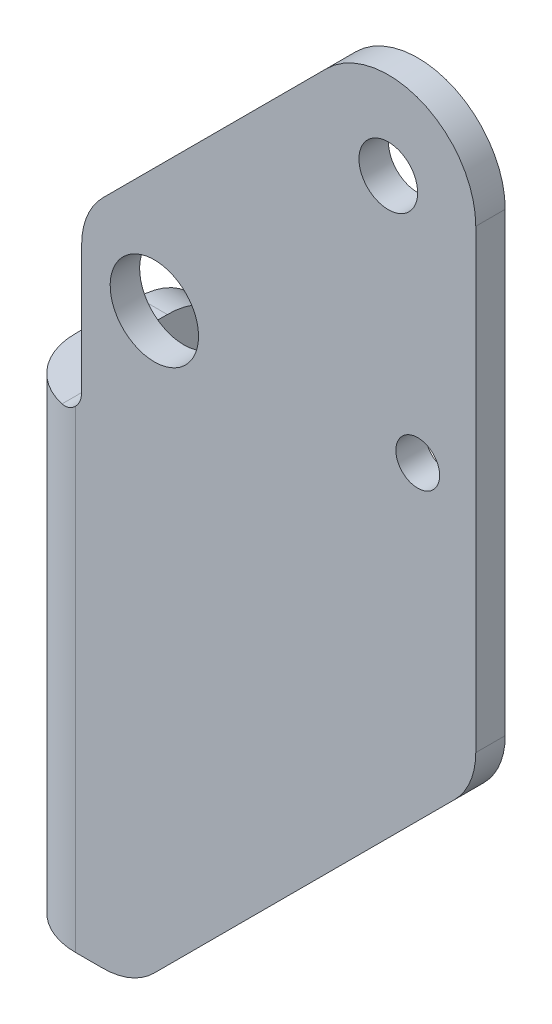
ISO-10303-21;
HEADER;
FILE_DESCRIPTION(('STEP AP214'),'2;1');
FILE_NAME('part.step','',(''),(''),'','','');
FILE_SCHEMA(('AUTOMOTIVE_DESIGN { 1 0 10303 214 1 1 1 1 }'));
ENDSEC;
DATA;
#1=APPLICATION_CONTEXT('core data for automotive mechanical design processes');
#2=APPLICATION_PROTOCOL_DEFINITION('international standard','automotive_design',2000,#1);
#3=PRODUCT_CONTEXT('',#1,'mechanical');
#4=PRODUCT('Part','Part','',(#3));
#5=PRODUCT_RELATED_PRODUCT_CATEGORY('part','',(#4));
#6=PRODUCT_DEFINITION_FORMATION('','',#4);
#7=PRODUCT_DEFINITION_CONTEXT('part definition',#1,'design');
#8=PRODUCT_DEFINITION('design','',#6,#7);
#9=PRODUCT_DEFINITION_SHAPE('','',#8);
#10=(LENGTH_UNIT() NAMED_UNIT(*) SI_UNIT(.MILLI.,.METRE.));
#11=(NAMED_UNIT(*) PLANE_ANGLE_UNIT() SI_UNIT($,.RADIAN.));
#12=(NAMED_UNIT(*) SI_UNIT($,.STERADIAN.) SOLID_ANGLE_UNIT());
#13=UNCERTAINTY_MEASURE_WITH_UNIT(LENGTH_MEASURE(1.E-05),#10,'distance_accuracy_value','');
#14=(GEOMETRIC_REPRESENTATION_CONTEXT(3) GLOBAL_UNCERTAINTY_ASSIGNED_CONTEXT((#13)) GLOBAL_UNIT_ASSIGNED_CONTEXT((#10,
#11,#12)) REPRESENTATION_CONTEXT('',''));
#15=CARTESIAN_POINT('',(0.,0.,0.));
#16=DIRECTION('',(0.,0.,1.));
#17=DIRECTION('',(1.,0.,0.));
#18=AXIS2_PLACEMENT_3D('',#15,#16,#17);
#19=CARTESIAN_POINT('',(181.03551824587,122.587317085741,7.90000000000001));
#20=DIRECTION('',(-1.,0.,0.));
#21=DIRECTION('',(0.,-1.,0.));
#22=AXIS2_PLACEMENT_3D('',#19,#20,#21);
#23=CYLINDRICAL_SURFACE('',#22,3.525);
#24=CARTESIAN_POINT('',(291.868420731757,122.587317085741,7.90000000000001));
#25=DIRECTION('',(-1.,0.,0.));
#26=DIRECTION('',(0.,-1.,0.));
#27=AXIS2_PLACEMENT_3D('',#24,#25,#26);
#28=CIRCLE('',#27,3.525);
#29=CARTESIAN_POINT('',(291.868420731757,119.062317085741,7.90000000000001));
#30=VERTEX_POINT('',#29);
#31=EDGE_CURVE('E18',#30,#30,#28,.T.);
#32=ORIENTED_EDGE('',*,*,#31,.T.);
#33=EDGE_LOOP('',(#32));
#34=FACE_BOUND('',#33,.T.);
#35=CARTESIAN_POINT('',(295.068420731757,122.587317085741,7.90000000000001));
#36=DIRECTION('',(-1.,0.,0.));
#37=DIRECTION('',(0.,-1.,0.));
#38=AXIS2_PLACEMENT_3D('',#35,#36,#37);
#39=CIRCLE('',#38,3.525);
#40=CARTESIAN_POINT('',(295.068420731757,119.062317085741,7.90000000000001));
#41=VERTEX_POINT('',#40);
#42=EDGE_CURVE('E298',#41,#41,#39,.F.);
#43=ORIENTED_EDGE('',*,*,#42,.T.);
#44=EDGE_LOOP('',(#43));
#45=FACE_BOUND('',#44,.T.);
#46=ADVANCED_FACE('F15',(#34,#45),#23,.F.);
#47=CARTESIAN_POINT('',(181.03551824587,141.687317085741,7.90000000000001));
#48=DIRECTION('',(-1.,0.,0.));
#49=DIRECTION('',(0.,-1.,0.));
#50=AXIS2_PLACEMENT_3D('',#47,#48,#49);
#51=CYLINDRICAL_SURFACE('',#50,3.525);
#52=CARTESIAN_POINT('',(291.868420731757,141.687317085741,7.90000000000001));
#53=DIRECTION('',(-1.,0.,0.));
#54=DIRECTION('',(0.,-1.,0.));
#55=AXIS2_PLACEMENT_3D('',#52,#53,#54);
#56=CIRCLE('',#55,3.525);
#57=CARTESIAN_POINT('',(291.868420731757,138.162317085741,7.90000000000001));
#58=VERTEX_POINT('',#57);
#59=EDGE_CURVE('E133',#58,#58,#56,.T.);
#60=ORIENTED_EDGE('',*,*,#59,.T.);
#61=EDGE_LOOP('',(#60));
#62=FACE_BOUND('',#61,.T.);
#63=CARTESIAN_POINT('',(295.068420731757,141.687317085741,7.90000000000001));
#64=DIRECTION('',(-1.,0.,0.));
#65=DIRECTION('',(0.,-1.,0.));
#66=AXIS2_PLACEMENT_3D('',#63,#64,#65);
#67=CIRCLE('',#66,3.525);
#68=CARTESIAN_POINT('',(295.068420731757,138.162317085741,7.90000000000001));
#69=VERTEX_POINT('',#68);
#70=EDGE_CURVE('E295',#69,#69,#67,.F.);
#71=ORIENTED_EDGE('',*,*,#70,.T.);
#72=EDGE_LOOP('',(#71));
#73=FACE_BOUND('',#72,.T.);
#74=ADVANCED_FACE('F234',(#62,#73),#51,.F.);
#75=CARTESIAN_POINT('',(181.03551824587,106.787317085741,7.90000000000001));
#76=DIRECTION('',(-1.,0.,0.));
#77=DIRECTION('',(0.,-1.,0.));
#78=AXIS2_PLACEMENT_3D('',#75,#76,#77);
#79=CYLINDRICAL_SURFACE('',#78,3.525);
#80=CARTESIAN_POINT('',(291.868420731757,106.787317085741,7.90000000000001));
#81=DIRECTION('',(-1.,0.,0.));
#82=DIRECTION('',(0.,-1.,0.));
#83=AXIS2_PLACEMENT_3D('',#80,#81,#82);
#84=CIRCLE('',#83,3.525);
#85=CARTESIAN_POINT('',(291.868420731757,103.262317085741,7.90000000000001));
#86=VERTEX_POINT('',#85);
#87=EDGE_CURVE('E130',#86,#86,#84,.T.);
#88=ORIENTED_EDGE('',*,*,#87,.T.);
#89=EDGE_LOOP('',(#88));
#90=FACE_BOUND('',#89,.T.);
#91=CARTESIAN_POINT('',(295.068420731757,106.787317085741,7.90000000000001));
#92=DIRECTION('',(-1.,0.,0.));
#93=DIRECTION('',(0.,-1.,0.));
#94=AXIS2_PLACEMENT_3D('',#91,#92,#93);
#95=CIRCLE('',#94,3.525);
#96=CARTESIAN_POINT('',(295.068420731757,103.262317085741,7.90000000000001));
#97=VERTEX_POINT('',#96);
#98=EDGE_CURVE('E291',#97,#97,#95,.F.);
#99=ORIENTED_EDGE('',*,*,#98,.T.);
#100=EDGE_LOOP('',(#99));
#101=FACE_BOUND('',#100,.T.);
#102=ADVANCED_FACE('F232',(#90,#101),#79,.F.);
#103=CARTESIAN_POINT('',(311.455139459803,145.417489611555,0.));
#104=DIRECTION('',(0.,0.,1.));
#105=DIRECTION('',(0.,-1.,0.));
#106=AXIS2_PLACEMENT_3D('',#103,#104,#105);
#107=PLANE('',#106);
#108=DIRECTION('',(0.,1.,0.));
#109=VECTOR('',#108,1.);
#110=CARTESIAN_POINT('',(291.868420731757,159.823703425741,0.));
#111=LINE('',#110,#109);
#112=CARTESIAN_POINT('',(291.868420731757,106.787317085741,0.));
#113=VERTEX_POINT('',#112);
#114=CARTESIAN_POINT('',(291.868420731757,141.687317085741,0.));
#115=VERTEX_POINT('',#114);
#116=EDGE_CURVE('E122',#113,#115,#111,.T.);
#117=ORIENTED_EDGE('',*,*,#116,.T.);
#118=DIRECTION('',(1.,0.,0.));
#119=VECTOR('',#118,1.);
#120=CARTESIAN_POINT('',(297.65678009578,141.687317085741,0.));
#121=LINE('',#120,#119);
#122=CARTESIAN_POINT('',(295.068420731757,141.687317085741,0.));
#123=VERTEX_POINT('',#122);
#124=EDGE_CURVE('E105',#123,#115,#121,.F.);
#125=ORIENTED_EDGE('',*,*,#124,.F.);
#126=DIRECTION('',(0.,-1.,0.));
#127=VECTOR('',#126,1.);
#128=CARTESIAN_POINT('',(295.068420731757,83.6203613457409,0.));
#129=LINE('',#128,#127);
#130=CARTESIAN_POINT('',(295.068420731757,106.787317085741,0.));
#131=VERTEX_POINT('',#130);
#132=EDGE_CURVE('E287',#123,#131,#129,.T.);
#133=ORIENTED_EDGE('',*,*,#132,.T.);
#134=DIRECTION('',(-1.,0.,0.));
#135=VECTOR('',#134,1.);
#136=CARTESIAN_POINT('',(308.529294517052,106.787317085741,0.));
#137=LINE('',#136,#135);
#138=EDGE_CURVE('E116',#113,#131,#137,.F.);
#139=ORIENTED_EDGE('',*,*,#138,.F.);
#140=EDGE_LOOP('',(#117,#125,#133,#139));
#141=FACE_BOUND('',#140,.T.);
#142=ADVANCED_FACE('F128',(#141),#107,.F.);
#143=CARTESIAN_POINT('',(297.65678009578,141.687317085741,7.90000000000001));
#144=DIRECTION('',(1.,0.,0.));
#145=DIRECTION('',(0.,0.,-1.));
#146=AXIS2_PLACEMENT_3D('',#143,#144,#145);
#147=CYLINDRICAL_SURFACE('',#146,7.9);
#148=CARTESIAN_POINT('',(291.868420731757,141.687317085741,7.90000000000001));
#149=DIRECTION('',(1.,0.,0.));
#150=DIRECTION('',(0.,0.,-1.));
#151=AXIS2_PLACEMENT_3D('',#148,#149,#150);
#152=CIRCLE('',#151,7.9);
#153=CARTESIAN_POINT('',(291.868420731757,149.587317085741,7.90000000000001));
#154=VERTEX_POINT('',#153);
#155=EDGE_CURVE('E109',#115,#154,#152,.T.);
#156=ORIENTED_EDGE('',*,*,#155,.T.);
#157=DIRECTION('',(1.,0.,0.));
#158=VECTOR('',#157,1.);
#159=CARTESIAN_POINT('',(283.858420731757,149.587317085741,7.90000000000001));
#160=LINE('',#159,#158);
#161=CARTESIAN_POINT('',(295.068420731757,149.587317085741,7.90000000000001));
#162=VERTEX_POINT('',#161);
#163=EDGE_CURVE('E146',#162,#154,#160,.F.);
#164=ORIENTED_EDGE('',*,*,#163,.F.);
#165=CARTESIAN_POINT('',(295.068420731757,141.687317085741,7.90000000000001));
#166=DIRECTION('',(1.,0.,0.));
#167=DIRECTION('',(0.,0.,-1.));
#168=AXIS2_PLACEMENT_3D('',#165,#166,#167);
#169=CIRCLE('',#168,7.9);
#170=EDGE_CURVE('E111',#162,#123,#169,.F.);
#171=ORIENTED_EDGE('',*,*,#170,.T.);
#172=ORIENTED_EDGE('',*,*,#124,.T.);
#173=EDGE_LOOP('',(#156,#164,#171,#172));
#174=FACE_BOUND('',#173,.T.);
#175=ADVANCED_FACE('F107',(#174),#147,.T.);
#176=CARTESIAN_POINT('',(308.529294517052,106.787317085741,7.90000000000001));
#177=DIRECTION('',(-1.,0.,0.));
#178=DIRECTION('',(0.,0.,1.));
#179=AXIS2_PLACEMENT_3D('',#176,#177,#178);
#180=CYLINDRICAL_SURFACE('',#179,7.9);
#181=CARTESIAN_POINT('',(295.068420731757,106.787317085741,7.90000000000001));
#182=DIRECTION('',(-1.,0.,0.));
#183=DIRECTION('',(0.,0.,1.));
#184=AXIS2_PLACEMENT_3D('',#181,#182,#183);
#185=CIRCLE('',#184,7.9);
#186=CARTESIAN_POINT('',(295.068420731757,98.8873170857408,7.90000000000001));
#187=VERTEX_POINT('',#186);
#188=EDGE_CURVE('E149',#131,#187,#185,.T.);
#189=ORIENTED_EDGE('',*,*,#188,.T.);
#190=DIRECTION('',(1.,0.,0.));
#191=VECTOR('',#190,1.);
#192=CARTESIAN_POINT('',(305.603449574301,98.8873170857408,7.90000000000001));
#193=LINE('',#192,#191);
#194=CARTESIAN_POINT('',(291.868420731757,98.8873170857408,7.90000000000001));
#195=VERTEX_POINT('',#194);
#196=EDGE_CURVE('E139',#195,#187,#193,.T.);
#197=ORIENTED_EDGE('',*,*,#196,.F.);
#198=CARTESIAN_POINT('',(291.868420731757,106.787317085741,7.90000000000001));
#199=DIRECTION('',(-1.,0.,0.));
#200=DIRECTION('',(0.,0.,1.));
#201=AXIS2_PLACEMENT_3D('',#198,#199,#200);
#202=CIRCLE('',#201,7.9);
#203=EDGE_CURVE('E126',#195,#113,#202,.F.);
#204=ORIENTED_EDGE('',*,*,#203,.T.);
#205=ORIENTED_EDGE('',*,*,#138,.T.);
#206=EDGE_LOOP('',(#189,#197,#204,#205));
#207=FACE_BOUND('',#206,.T.);
#208=ADVANCED_FACE('F224',(#207),#180,.T.);
#209=CARTESIAN_POINT('',(291.868420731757,159.823703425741,0.));
#210=DIRECTION('',(1.,0.,0.));
#211=DIRECTION('',(0.,0.,-1.));
#212=AXIS2_PLACEMENT_3D('',#209,#210,#211);
#213=PLANE('',#212);
#214=DIRECTION('',(0.,0.,-1.));
#215=VECTOR('',#214,1.);
#216=CARTESIAN_POINT('',(291.868420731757,98.8873170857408,0.));
#217=LINE('',#216,#215);
#218=CARTESIAN_POINT('',(291.868420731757,98.8873170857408,14.7));
#219=VERTEX_POINT('',#218);
#220=EDGE_CURVE('E313',#219,#195,#217,.T.);
#221=ORIENTED_EDGE('',*,*,#220,.F.);
#222=DIRECTION('',(0.,-1.,0.));
#223=VECTOR('',#222,1.);
#224=CARTESIAN_POINT('',(291.868420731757,152.620596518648,14.7));
#225=LINE('',#224,#223);
#226=CARTESIAN_POINT('',(291.868420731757,149.587317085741,14.7));
#227=VERTEX_POINT('',#226);
#228=EDGE_CURVE('E143',#227,#219,#225,.T.);
#229=ORIENTED_EDGE('',*,*,#228,.F.);
#230=DIRECTION('',(0.,0.,1.));
#231=VECTOR('',#230,1.);
#232=CARTESIAN_POINT('',(291.868420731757,149.587317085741,0.));
#233=LINE('',#232,#231);
#234=EDGE_CURVE('E125',#154,#227,#233,.T.);
#235=ORIENTED_EDGE('',*,*,#234,.F.);
#236=ORIENTED_EDGE('',*,*,#155,.F.);
#237=ORIENTED_EDGE('',*,*,#116,.F.);
#238=ORIENTED_EDGE('',*,*,#203,.F.);
#239=EDGE_LOOP('',(#221,#229,#235,#236,#237,#238));
#240=FACE_BOUND('',#239,.T.);
#241=ORIENTED_EDGE('',*,*,#87,.F.);
#242=EDGE_LOOP('',(#241));
#243=FACE_BOUND('',#242,.T.);
#244=ORIENTED_EDGE('',*,*,#59,.F.);
#245=EDGE_LOOP('',(#244));
#246=FACE_BOUND('',#245,.T.);
#247=ORIENTED_EDGE('',*,*,#31,.F.);
#248=EDGE_LOOP('',(#247));
#249=FACE_BOUND('',#248,.T.);
#250=ADVANCED_FACE('F120',(#240,#243,#246,#249),#213,.F.);
#251=CARTESIAN_POINT('',(299.368420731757,152.620596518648,14.7));
#252=DIRECTION('',(0.,-1.,0.));
#253=DIRECTION('',(1.,0.,0.));
#254=AXIS2_PLACEMENT_3D('',#251,#252,#253);
#255=CYLINDRICAL_SURFACE('',#254,7.5);
#256=CARTESIAN_POINT('',(299.368420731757,149.587317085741,14.7));
#257=DIRECTION('',(0.,-1.,0.));
#258=DIRECTION('',(1.,0.,0.));
#259=AXIS2_PLACEMENT_3D('',#256,#257,#258);
#260=CIRCLE('',#259,7.5);
#261=CARTESIAN_POINT('',(297.758420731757,149.587317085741,22.0251552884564));
#262=VERTEX_POINT('',#261);
#263=EDGE_CURVE('E336',#227,#262,#260,.F.);
#264=ORIENTED_EDGE('',*,*,#263,.F.);
#265=ORIENTED_EDGE('',*,*,#228,.T.);
#266=CARTESIAN_POINT('',(299.368420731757,98.8873170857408,14.7));
#267=DIRECTION('',(0.,-1.,0.));
#268=DIRECTION('',(1.,0.,0.));
#269=AXIS2_PLACEMENT_3D('',#266,#267,#268);
#270=CIRCLE('',#269,7.5);
#271=CARTESIAN_POINT('',(299.368420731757,98.8873170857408,22.2));
#272=VERTEX_POINT('',#271);
#273=EDGE_CURVE('E320',#272,#219,#270,.T.);
#274=ORIENTED_EDGE('',*,*,#273,.F.);
#275=DIRECTION('',(0.,-1.,0.));
#276=VECTOR('',#275,1.);
#277=CARTESIAN_POINT('',(299.368420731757,145.417489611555,22.2));
#278=LINE('',#277,#276);
#279=CARTESIAN_POINT('',(299.368420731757,150.244788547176,22.2));
#280=VERTEX_POINT('',#279);
#281=EDGE_CURVE('E145',#280,#272,#278,.T.);
#282=ORIENTED_EDGE('',*,*,#281,.F.);
#283=CARTESIAN_POINT('',(297.758420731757,149.587317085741,22.0251552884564));
#284=CARTESIAN_POINT('',(297.819881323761,149.587309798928,22.0386710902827));
#285=CARTESIAN_POINT('',(297.881517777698,149.589780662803,22.0514000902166));
#286=CARTESIAN_POINT('',(298.004708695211,149.599708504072,22.0752422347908));
#287=CARTESIAN_POINT('',(298.066263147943,149.607166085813,22.0863551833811));
#288=CARTESIAN_POINT('',(298.188844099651,149.627097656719,22.1069201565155));
#289=CARTESIAN_POINT('',(298.249870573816,149.639571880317,22.1163721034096));
#290=CARTESIAN_POINT('',(298.370908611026,149.669491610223,22.1336205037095));
#291=CARTESIAN_POINT('',(298.430920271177,149.686936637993,22.1414171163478));
#292=CARTESIAN_POINT('',(298.608913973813,149.746685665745,22.1623972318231));
#293=CARTESIAN_POINT('',(298.724791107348,149.796393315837,22.1731605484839));
#294=CARTESIAN_POINT('',(298.946948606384,149.914201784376,22.1889769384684));
#295=CARTESIAN_POINT('',(299.053245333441,149.982270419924,22.1940399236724));
#296=CARTESIAN_POINT('',(299.190979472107,150.087305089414,22.1979966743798));
#297=CARTESIAN_POINT('',(299.227852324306,150.117279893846,22.1987689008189));
#298=CARTESIAN_POINT('',(299.2996261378,150.179414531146,22.1997699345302));
#299=CARTESIAN_POINT('',(299.33452979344,150.211571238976,22.1999995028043));
#300=CARTESIAN_POINT('',(299.368420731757,150.244788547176,22.2));
#301=B_SPLINE_CURVE_WITH_KNOTS('',3,(#283,#284,#285,#286,#287,#288,#289,#290,#291,#292,#293,
#294,#295,#296,#297,#298,#299,#300),.UNSPECIFIED.,.F.,.F.,(4,2,2,2,2,2,2,2,4),(0.,
0.188737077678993,0.377497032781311,0.566265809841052,0.755016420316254,1.13271100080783,
1.50974781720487,1.65225097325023,1.79455416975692),.UNSPECIFIED.);
#302=EDGE_CURVE('E205',#262,#280,#301,.T.);
#303=ORIENTED_EDGE('',*,*,#302,.F.);
#304=EDGE_LOOP('',(#264,#265,#274,#282,#303));
#305=FACE_BOUND('',#304,.T.);
#306=ADVANCED_FACE('F214',(#305),#255,.T.);
#307=CARTESIAN_POINT('',(311.455139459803,145.417489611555,22.2));
#308=DIRECTION('',(0.,0.,1.));
#309=DIRECTION('',(0.,-1.,0.));
#310=AXIS2_PLACEMENT_3D('',#307,#308,#309);
#311=PLANE('',#310);
#312=DIRECTION('',(0.,-1.,0.));
#313=VECTOR('',#312,1.);
#314=CARTESIAN_POINT('',(300.058420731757,149.587317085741,22.2));
#315=LINE('',#314,#313);
#316=CARTESIAN_POINT('',(300.058420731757,151.887317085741,22.2));
#317=VERTEX_POINT('',#316);
#318=CARTESIAN_POINT('',(300.058420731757,165.787317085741,22.2));
#319=VERTEX_POINT('',#318);
#320=EDGE_CURVE('E344',#317,#319,#315,.F.);
#321=ORIENTED_EDGE('',*,*,#320,.F.);
#322=CARTESIAN_POINT('',(297.758420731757,151.887317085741,22.2));
#323=DIRECTION('',(0.,0.,1.));
#324=DIRECTION('',(1.,0.,0.));
#325=AXIS2_PLACEMENT_3D('',#322,#323,#324);
#326=CIRCLE('',#325,2.30000000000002);
#327=EDGE_CURVE('E192',#280,#317,#326,.T.);
#328=ORIENTED_EDGE('',*,*,#327,.F.);
#329=ORIENTED_EDGE('',*,*,#281,.T.);
#330=DIRECTION('',(1.,0.,0.));
#331=VECTOR('',#330,1.);
#332=CARTESIAN_POINT('',(305.603449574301,98.8873170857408,22.2));
#333=LINE('',#332,#331);
#334=CARTESIAN_POINT('',(302.331162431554,98.8873170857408,22.2));
#335=VERTEX_POINT('',#334);
#336=EDGE_CURVE('E325',#335,#272,#333,.F.);
#337=ORIENTED_EDGE('',*,*,#336,.F.);
#338=CARTESIAN_POINT('',(302.331162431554,106.787317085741,22.2));
#339=DIRECTION('',(0.,0.,1.));
#340=DIRECTION('',(1.,0.,0.));
#341=AXIS2_PLACEMENT_3D('',#338,#339,#340);
#342=CIRCLE('',#341,7.9);
#343=CARTESIAN_POINT('',(307.917306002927,101.201173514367,22.2));
#344=VERTEX_POINT('',#343);
#345=EDGE_CURVE('E321',#344,#335,#342,.F.);
#346=ORIENTED_EDGE('',*,*,#345,.F.);
#347=DIRECTION('',(0.707106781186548,0.707106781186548,0.));
#348=VECTOR('',#347,1.);
#349=CARTESIAN_POINT('',(340.55456430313,133.83843181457,22.2));
#350=LINE('',#349,#348);
#351=CARTESIAN_POINT('',(340.55456430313,133.83843181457,22.2));
#352=VERTEX_POINT('',#351);
#353=EDGE_CURVE('E137',#352,#344,#350,.F.);
#354=ORIENTED_EDGE('',*,*,#353,.F.);
#355=CARTESIAN_POINT('',(334.968420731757,139.424575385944,22.2));
#356=DIRECTION('',(0.,0.,1.));
#357=DIRECTION('',(1.,0.,0.));
#358=AXIS2_PLACEMENT_3D('',#355,#356,#357);
#359=CIRCLE('',#358,7.9);
#360=CARTESIAN_POINT('',(342.868420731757,139.424575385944,22.2));
#361=VERTEX_POINT('',#360);
#362=EDGE_CURVE('E361',#361,#352,#359,.F.);
#363=ORIENTED_EDGE('',*,*,#362,.F.);
#364=DIRECTION('',(0.,1.,0.));
#365=VECTOR('',#364,1.);
#366=CARTESIAN_POINT('',(342.868420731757,188.934575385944,22.2));
#367=LINE('',#366,#365);
#368=CARTESIAN_POINT('',(342.868420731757,188.934575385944,22.2));
#369=VERTEX_POINT('',#368);
#370=EDGE_CURVE('E350',#369,#361,#367,.F.);
#371=ORIENTED_EDGE('',*,*,#370,.F.);
#372=CARTESIAN_POINT('',(333.368420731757,188.934575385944,22.2));
#373=DIRECTION('',(0.,0.,1.));
#374=DIRECTION('',(1.,0.,0.));
#375=AXIS2_PLACEMENT_3D('',#372,#373,#374);
#376=CIRCLE('',#375,9.5);
#377=CARTESIAN_POINT('',(326.650906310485,195.652089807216,22.2));
#378=VERTEX_POINT('',#377);
#379=EDGE_CURVE('E358',#378,#369,#376,.F.);
#380=ORIENTED_EDGE('',*,*,#379,.F.);
#381=DIRECTION('',(-0.707106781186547,-0.707106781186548,0.));
#382=VECTOR('',#381,1.);
#383=CARTESIAN_POINT('',(302.372277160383,171.373460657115,22.2));
#384=LINE('',#383,#382);
#385=CARTESIAN_POINT('',(302.372277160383,171.373460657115,22.2));
#386=VERTEX_POINT('',#385);
#387=EDGE_CURVE('E347',#386,#378,#384,.F.);
#388=ORIENTED_EDGE('',*,*,#387,.F.);
#389=CARTESIAN_POINT('',(307.958420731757,165.787317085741,22.2));
#390=DIRECTION('',(0.,0.,1.));
#391=DIRECTION('',(1.,0.,0.));
#392=AXIS2_PLACEMENT_3D('',#389,#390,#391);
#393=CIRCLE('',#392,7.9);
#394=EDGE_CURVE('E212',#319,#386,#393,.F.);
#395=ORIENTED_EDGE('',*,*,#394,.F.);
#396=EDGE_LOOP('',(#321,#328,#329,#337,#346,#354,#363,#371,#380,#388,#395));
#397=FACE_BOUND('',#396,.T.);
#398=CARTESIAN_POINT('',(333.368420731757,188.934575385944,22.2));
#399=DIRECTION('',(0.,0.,-1.));
#400=DIRECTION('',(0.,1.,0.));
#401=AXIS2_PLACEMENT_3D('',#398,#399,#400);
#402=CIRCLE('',#401,3.1875);
#403=CARTESIAN_POINT('',(333.368420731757,192.122075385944,22.2));
#404=VERTEX_POINT('',#403);
#405=EDGE_CURVE('E142',#404,#404,#402,.T.);
#406=ORIENTED_EDGE('',*,*,#405,.T.);
#407=EDGE_LOOP('',(#406));
#408=FACE_BOUND('',#407,.T.);
#409=CARTESIAN_POINT('',(307.958420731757,163.524575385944,22.2));
#410=DIRECTION('',(0.,0.,1.));
#411=DIRECTION('',(0.,-1.,0.));
#412=AXIS2_PLACEMENT_3D('',#409,#410,#411);
#413=CIRCLE('',#412,4.8);
#414=CARTESIAN_POINT('',(307.958420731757,158.724575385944,22.2));
#415=VERTEX_POINT('',#414);
#416=EDGE_CURVE('E409',#415,#415,#413,.F.);
#417=ORIENTED_EDGE('',*,*,#416,.T.);
#418=EDGE_LOOP('',(#417));
#419=FACE_BOUND('',#418,.T.);
#420=CARTESIAN_POINT('',(336.568420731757,163.524575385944,22.2));
#421=DIRECTION('',(0.,0.,1.));
#422=DIRECTION('',(0.,-1.,0.));
#423=AXIS2_PLACEMENT_3D('',#420,#421,#422);
#424=CIRCLE('',#423,2.38);
#425=CARTESIAN_POINT('',(336.568420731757,161.144575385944,22.2));
#426=VERTEX_POINT('',#425);
#427=EDGE_CURVE('E335',#426,#426,#424,.F.);
#428=ORIENTED_EDGE('',*,*,#427,.T.);
#429=EDGE_LOOP('',(#428));
#430=FACE_BOUND('',#429,.T.);
#431=ADVANCED_FACE('F219',(#397,#408,#419,#430),#311,.T.);
#432=CARTESIAN_POINT('',(295.068420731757,83.6203613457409,0.));
#433=DIRECTION('',(-1.,0.,0.));
#434=DIRECTION('',(0.,-1.,0.));
#435=AXIS2_PLACEMENT_3D('',#432,#433,#434);
#436=PLANE('',#435);
#437=ORIENTED_EDGE('',*,*,#132,.F.);
#438=ORIENTED_EDGE('',*,*,#170,.F.);
#439=DIRECTION('',(0.,0.,1.));
#440=VECTOR('',#439,1.);
#441=CARTESIAN_POINT('',(295.068420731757,149.587317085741,0.));
#442=LINE('',#441,#440);
#443=CARTESIAN_POINT('',(295.068420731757,149.587317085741,15.));
#444=VERTEX_POINT('',#443);
#445=EDGE_CURVE('E332',#444,#162,#442,.F.);
#446=ORIENTED_EDGE('',*,*,#445,.F.);
#447=DIRECTION('',(0.,1.,0.));
#448=VECTOR('',#447,1.);
#449=CARTESIAN_POINT('',(295.068420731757,114.287519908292,15.));
#450=LINE('',#449,#448);
#451=CARTESIAN_POINT('',(295.068420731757,98.8873170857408,15.));
#452=VERTEX_POINT('',#451);
#453=EDGE_CURVE('E181',#452,#444,#450,.T.);
#454=ORIENTED_EDGE('',*,*,#453,.F.);
#455=DIRECTION('',(0.,0.,-1.));
#456=VECTOR('',#455,1.);
#457=CARTESIAN_POINT('',(295.068420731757,98.8873170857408,0.));
#458=LINE('',#457,#456);
#459=EDGE_CURVE('E141',#187,#452,#458,.F.);
#460=ORIENTED_EDGE('',*,*,#459,.F.);
#461=ORIENTED_EDGE('',*,*,#188,.F.);
#462=EDGE_LOOP('',(#437,#438,#446,#454,#460,#461));
#463=FACE_BOUND('',#462,.T.);
#464=ORIENTED_EDGE('',*,*,#98,.F.);
#465=EDGE_LOOP('',(#464));
#466=FACE_BOUND('',#465,.T.);
#467=ORIENTED_EDGE('',*,*,#70,.F.);
#468=EDGE_LOOP('',(#467));
#469=FACE_BOUND('',#468,.T.);
#470=ORIENTED_EDGE('',*,*,#42,.F.);
#471=EDGE_LOOP('',(#470));
#472=FACE_BOUND('',#471,.T.);
#473=ADVANCED_FACE('F274',(#463,#466,#469,#472),#436,.F.);
#474=CARTESIAN_POINT('',(283.858420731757,149.587317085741,0.));
#475=DIRECTION('',(0.,1.,0.));
#476=DIRECTION('',(0.,0.,1.));
#477=AXIS2_PLACEMENT_3D('',#474,#475,#476);
#478=PLANE('',#477);
#479=CARTESIAN_POINT('',(299.068420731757,149.587317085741,15.));
#480=DIRECTION('',(0.,1.,0.));
#481=DIRECTION('',(0.,0.,1.));
#482=AXIS2_PLACEMENT_3D('',#479,#480,#481);
#483=CIRCLE('',#482,4.);
#484=CARTESIAN_POINT('',(297.758420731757,149.587317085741,18.7794047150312));
#485=VERTEX_POINT('',#484);
#486=EDGE_CURVE('E179',#444,#485,#483,.T.);
#487=ORIENTED_EDGE('',*,*,#486,.F.);
#488=ORIENTED_EDGE('',*,*,#445,.T.);
#489=ORIENTED_EDGE('',*,*,#163,.T.);
#490=ORIENTED_EDGE('',*,*,#234,.T.);
#491=ORIENTED_EDGE('',*,*,#263,.T.);
#492=DIRECTION('',(0.,0.,1.));
#493=VECTOR('',#492,1.);
#494=CARTESIAN_POINT('',(297.758420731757,149.587317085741,0.));
#495=LINE('',#494,#493);
#496=EDGE_CURVE('E191',#485,#262,#495,.T.);
#497=ORIENTED_EDGE('',*,*,#496,.F.);
#498=EDGE_LOOP('',(#487,#488,#489,#490,#491,#497));
#499=FACE_BOUND('',#498,.T.);
#500=ADVANCED_FACE('F264',(#499),#478,.T.);
#501=CARTESIAN_POINT('',(336.568420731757,163.524575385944,133.032902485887));
#502=DIRECTION('',(0.,0.,1.));
#503=DIRECTION('',(0.,-1.,0.));
#504=AXIS2_PLACEMENT_3D('',#501,#502,#503);
#505=CYLINDRICAL_SURFACE('',#504,2.38);
#506=ORIENTED_EDGE('',*,*,#427,.F.);
#507=EDGE_LOOP('',(#506));
#508=FACE_BOUND('',#507,.T.);
#509=CARTESIAN_POINT('',(336.568420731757,163.524575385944,19.));
#510=DIRECTION('',(0.,0.,1.));
#511=DIRECTION('',(0.,-1.,0.));
#512=AXIS2_PLACEMENT_3D('',#509,#510,#511);
#513=CIRCLE('',#512,2.38);
#514=CARTESIAN_POINT('',(336.568420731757,161.144575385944,19.));
#515=VERTEX_POINT('',#514);
#516=EDGE_CURVE('E176',#515,#515,#513,.F.);
#517=ORIENTED_EDGE('',*,*,#516,.T.);
#518=EDGE_LOOP('',(#517));
#519=FACE_BOUND('',#518,.T.);
#520=ADVANCED_FACE('F261',(#508,#519),#505,.F.);
#521=CARTESIAN_POINT('',(307.958420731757,163.524575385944,133.032902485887));
#522=DIRECTION('',(0.,0.,1.));
#523=DIRECTION('',(0.,-1.,0.));
#524=AXIS2_PLACEMENT_3D('',#521,#522,#523);
#525=CYLINDRICAL_SURFACE('',#524,4.8);
#526=ORIENTED_EDGE('',*,*,#416,.F.);
#527=EDGE_LOOP('',(#526));
#528=FACE_BOUND('',#527,.T.);
#529=CARTESIAN_POINT('',(307.958420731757,163.524575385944,19.));
#530=DIRECTION('',(0.,0.,1.));
#531=DIRECTION('',(0.,-1.,0.));
#532=AXIS2_PLACEMENT_3D('',#529,#530,#531);
#533=CIRCLE('',#532,4.8);
#534=CARTESIAN_POINT('',(307.958420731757,158.724575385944,19.));
#535=VERTEX_POINT('',#534);
#536=EDGE_CURVE('E173',#535,#535,#533,.F.);
#537=ORIENTED_EDGE('',*,*,#536,.T.);
#538=EDGE_LOOP('',(#537));
#539=FACE_BOUND('',#538,.T.);
#540=ADVANCED_FACE('F263',(#528,#539),#525,.F.);
#541=CARTESIAN_POINT('',(333.368420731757,188.934575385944,-91.8329024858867));
#542=DIRECTION('',(0.,0.,-1.));
#543=DIRECTION('',(0.,1.,0.));
#544=AXIS2_PLACEMENT_3D('',#541,#542,#543);
#545=CYLINDRICAL_SURFACE('',#544,3.1875);
#546=CARTESIAN_POINT('',(333.368420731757,188.934575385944,19.));
#547=DIRECTION('',(0.,0.,-1.));
#548=DIRECTION('',(0.,1.,0.));
#549=AXIS2_PLACEMENT_3D('',#546,#547,#548);
#550=CIRCLE('',#549,3.1875);
#551=CARTESIAN_POINT('',(333.368420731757,192.122075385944,19.));
#552=VERTEX_POINT('',#551);
#553=EDGE_CURVE('E170',#552,#552,#550,.T.);
#554=ORIENTED_EDGE('',*,*,#553,.T.);
#555=EDGE_LOOP('',(#554));
#556=FACE_BOUND('',#555,.T.);
#557=ORIENTED_EDGE('',*,*,#405,.F.);
#558=EDGE_LOOP('',(#557));
#559=FACE_BOUND('',#558,.T.);
#560=ADVANCED_FACE('F271',(#556,#559),#545,.F.);
#561=CARTESIAN_POINT('',(305.603449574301,98.8873170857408,0.));
#562=DIRECTION('',(0.,-1.,0.));
#563=DIRECTION('',(0.,0.,-1.));
#564=AXIS2_PLACEMENT_3D('',#561,#562,#563);
#565=PLANE('',#564);
#566=ORIENTED_EDGE('',*,*,#273,.T.);
#567=ORIENTED_EDGE('',*,*,#220,.T.);
#568=ORIENTED_EDGE('',*,*,#196,.T.);
#569=ORIENTED_EDGE('',*,*,#459,.T.);
#570=CARTESIAN_POINT('',(299.068420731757,98.8873170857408,15.));
#571=DIRECTION('',(0.,1.,0.));
#572=DIRECTION('',(0.,0.,1.));
#573=AXIS2_PLACEMENT_3D('',#570,#571,#572);
#574=CIRCLE('',#573,4.);
#575=CARTESIAN_POINT('',(299.068420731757,98.8873170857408,19.));
#576=VERTEX_POINT('',#575);
#577=EDGE_CURVE('E182',#576,#452,#574,.F.);
#578=ORIENTED_EDGE('',*,*,#577,.F.);
#579=DIRECTION('',(1.,0.,0.));
#580=VECTOR('',#579,1.);
#581=CARTESIAN_POINT('',(323.952021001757,98.8873170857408,19.));
#582=LINE('',#581,#580);
#583=CARTESIAN_POINT('',(302.331162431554,98.8873170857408,19.));
#584=VERTEX_POINT('',#583);
#585=EDGE_CURVE('E169',#576,#584,#582,.T.);
#586=ORIENTED_EDGE('',*,*,#585,.T.);
#587=DIRECTION('',(0.,0.,1.));
#588=VECTOR('',#587,1.);
#589=CARTESIAN_POINT('',(302.331162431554,98.8873170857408,0.));
#590=LINE('',#589,#588);
#591=EDGE_CURVE('E323',#335,#584,#590,.F.);
#592=ORIENTED_EDGE('',*,*,#591,.F.);
#593=ORIENTED_EDGE('',*,*,#336,.T.);
#594=EDGE_LOOP('',(#566,#567,#568,#569,#578,#586,#592,#593));
#595=FACE_BOUND('',#594,.T.);
#596=ADVANCED_FACE('F316',(#595),#565,.T.);
#597=CARTESIAN_POINT('',(302.331162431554,106.787317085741,0.));
#598=DIRECTION('',(0.,0.,1.));
#599=DIRECTION('',(1.,0.,0.));
#600=AXIS2_PLACEMENT_3D('',#597,#598,#599);
#601=CYLINDRICAL_SURFACE('',#600,7.9);
#602=ORIENTED_EDGE('',*,*,#345,.T.);
#603=ORIENTED_EDGE('',*,*,#591,.T.);
#604=CARTESIAN_POINT('',(302.331162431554,106.787317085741,19.));
#605=DIRECTION('',(0.,0.,1.));
#606=DIRECTION('',(1.,0.,0.));
#607=AXIS2_PLACEMENT_3D('',#604,#605,#606);
#608=CIRCLE('',#607,7.9);
#609=CARTESIAN_POINT('',(307.917306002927,101.201173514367,19.));
#610=VERTEX_POINT('',#609);
#611=EDGE_CURVE('E166',#584,#610,#608,.T.);
#612=ORIENTED_EDGE('',*,*,#611,.T.);
#613=DIRECTION('',(0.,0.,1.));
#614=VECTOR('',#613,1.);
#615=CARTESIAN_POINT('',(307.917306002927,101.201173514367,0.));
#616=LINE('',#615,#614);
#617=EDGE_CURVE('E367',#344,#610,#616,.F.);
#618=ORIENTED_EDGE('',*,*,#617,.F.);
#619=EDGE_LOOP('',(#602,#603,#612,#618));
#620=FACE_BOUND('',#619,.T.);
#621=ADVANCED_FACE('F383',(#620),#601,.T.);
#622=CARTESIAN_POINT('',(340.55456430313,133.83843181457,0.));
#623=DIRECTION('',(0.707106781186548,-0.707106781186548,0.));
#624=DIRECTION('',(0.707106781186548,0.707106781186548,0.));
#625=AXIS2_PLACEMENT_3D('',#622,#623,#624);
#626=PLANE('',#625);
#627=ORIENTED_EDGE('',*,*,#353,.T.);
#628=ORIENTED_EDGE('',*,*,#617,.T.);
#629=DIRECTION('',(0.707106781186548,0.707106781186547,0.));
#630=VECTOR('',#629,1.);
#631=CARTESIAN_POINT('',(307.917306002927,101.201173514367,19.));
#632=LINE('',#631,#630);
#633=CARTESIAN_POINT('',(340.55456430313,133.83843181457,19.));
#634=VERTEX_POINT('',#633);
#635=EDGE_CURVE('E165',#610,#634,#632,.T.);
#636=ORIENTED_EDGE('',*,*,#635,.T.);
#637=DIRECTION('',(0.,0.,1.));
#638=VECTOR('',#637,1.);
#639=CARTESIAN_POINT('',(340.55456430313,133.83843181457,0.));
#640=LINE('',#639,#638);
#641=EDGE_CURVE('E352',#352,#634,#640,.F.);
#642=ORIENTED_EDGE('',*,*,#641,.F.);
#643=EDGE_LOOP('',(#627,#628,#636,#642));
#644=FACE_BOUND('',#643,.T.);
#645=ADVANCED_FACE('F444',(#644),#626,.T.);
#646=CARTESIAN_POINT('',(334.968420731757,139.424575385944,0.));
#647=DIRECTION('',(0.,0.,1.));
#648=DIRECTION('',(1.,0.,0.));
#649=AXIS2_PLACEMENT_3D('',#646,#647,#648);
#650=CYLINDRICAL_SURFACE('',#649,7.9);
#651=ORIENTED_EDGE('',*,*,#362,.T.);
#652=ORIENTED_EDGE('',*,*,#641,.T.);
#653=CARTESIAN_POINT('',(334.968420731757,139.424575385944,19.));
#654=DIRECTION('',(0.,0.,1.));
#655=DIRECTION('',(1.,0.,0.));
#656=AXIS2_PLACEMENT_3D('',#653,#654,#655);
#657=CIRCLE('',#656,7.9);
#658=CARTESIAN_POINT('',(342.868420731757,139.424575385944,19.));
#659=VERTEX_POINT('',#658);
#660=EDGE_CURVE('E162',#634,#659,#657,.T.);
#661=ORIENTED_EDGE('',*,*,#660,.T.);
#662=DIRECTION('',(0.,0.,-1.));
#663=VECTOR('',#662,1.);
#664=CARTESIAN_POINT('',(342.868420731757,139.424575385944,0.));
#665=LINE('',#664,#663);
#666=EDGE_CURVE('E351',#361,#659,#665,.T.);
#667=ORIENTED_EDGE('',*,*,#666,.F.);
#668=EDGE_LOOP('',(#651,#652,#661,#667));
#669=FACE_BOUND('',#668,.T.);
#670=ADVANCED_FACE('F442',(#669),#650,.T.);
#671=CARTESIAN_POINT('',(342.868420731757,188.934575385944,0.));
#672=DIRECTION('',(1.,0.,0.));
#673=DIRECTION('',(0.,0.,-1.));
#674=AXIS2_PLACEMENT_3D('',#671,#672,#673);
#675=PLANE('',#674);
#676=ORIENTED_EDGE('',*,*,#370,.T.);
#677=ORIENTED_EDGE('',*,*,#666,.T.);
#678=DIRECTION('',(0.,-1.,0.));
#679=VECTOR('',#678,1.);
#680=CARTESIAN_POINT('',(342.868420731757,144.954678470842,19.));
#681=LINE('',#680,#679);
#682=CARTESIAN_POINT('',(342.868420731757,188.934575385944,19.));
#683=VERTEX_POINT('',#682);
#684=EDGE_CURVE('E161',#659,#683,#681,.F.);
#685=ORIENTED_EDGE('',*,*,#684,.T.);
#686=DIRECTION('',(0.,0.,1.));
#687=VECTOR('',#686,1.);
#688=CARTESIAN_POINT('',(342.868420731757,188.934575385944,0.));
#689=LINE('',#688,#687);
#690=EDGE_CURVE('E349',#369,#683,#689,.F.);
#691=ORIENTED_EDGE('',*,*,#690,.F.);
#692=EDGE_LOOP('',(#676,#677,#685,#691));
#693=FACE_BOUND('',#692,.T.);
#694=ADVANCED_FACE('F435',(#693),#675,.T.);
#695=CARTESIAN_POINT('',(333.368420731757,188.934575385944,0.));
#696=DIRECTION('',(0.,0.,1.));
#697=DIRECTION('',(1.,0.,0.));
#698=AXIS2_PLACEMENT_3D('',#695,#696,#697);
#699=CYLINDRICAL_SURFACE('',#698,9.5);
#700=ORIENTED_EDGE('',*,*,#379,.T.);
#701=ORIENTED_EDGE('',*,*,#690,.T.);
#702=CARTESIAN_POINT('',(333.368420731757,188.934575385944,19.));
#703=DIRECTION('',(0.,0.,1.));
#704=DIRECTION('',(1.,0.,0.));
#705=AXIS2_PLACEMENT_3D('',#702,#703,#704);
#706=CIRCLE('',#705,9.5);
#707=CARTESIAN_POINT('',(326.650906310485,195.652089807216,19.));
#708=VERTEX_POINT('',#707);
#709=EDGE_CURVE('E158',#683,#708,#706,.T.);
#710=ORIENTED_EDGE('',*,*,#709,.T.);
#711=DIRECTION('',(0.,0.,1.));
#712=VECTOR('',#711,1.);
#713=CARTESIAN_POINT('',(326.650906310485,195.652089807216,0.));
#714=LINE('',#713,#712);
#715=EDGE_CURVE('E348',#378,#708,#714,.F.);
#716=ORIENTED_EDGE('',*,*,#715,.F.);
#717=EDGE_LOOP('',(#700,#701,#710,#716));
#718=FACE_BOUND('',#717,.T.);
#719=ADVANCED_FACE('F458',(#718),#699,.T.);
#720=CARTESIAN_POINT('',(302.372277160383,171.373460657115,0.));
#721=DIRECTION('',(-0.707106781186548,0.707106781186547,0.));
#722=DIRECTION('',(-0.707106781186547,-0.707106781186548,0.));
#723=AXIS2_PLACEMENT_3D('',#720,#721,#722);
#724=PLANE('',#723);
#725=ORIENTED_EDGE('',*,*,#387,.T.);
#726=ORIENTED_EDGE('',*,*,#715,.T.);
#727=DIRECTION('',(-0.70710678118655,-0.707106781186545,0.));
#728=VECTOR('',#727,1.);
#729=CARTESIAN_POINT('',(326.650906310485,195.652089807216,19.));
#730=LINE('',#729,#728);
#731=CARTESIAN_POINT('',(302.372277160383,171.373460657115,19.));
#732=VERTEX_POINT('',#731);
#733=EDGE_CURVE('E157',#708,#732,#730,.T.);
#734=ORIENTED_EDGE('',*,*,#733,.T.);
#735=DIRECTION('',(0.,0.,1.));
#736=VECTOR('',#735,1.);
#737=CARTESIAN_POINT('',(302.372277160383,171.373460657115,0.));
#738=LINE('',#737,#736);
#739=EDGE_CURVE('E345',#386,#732,#738,.F.);
#740=ORIENTED_EDGE('',*,*,#739,.F.);
#741=EDGE_LOOP('',(#725,#726,#734,#740));
#742=FACE_BOUND('',#741,.T.);
#743=ADVANCED_FACE('F457',(#742),#724,.T.);
#744=CARTESIAN_POINT('',(307.958420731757,165.787317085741,0.));
#745=DIRECTION('',(0.,0.,1.));
#746=DIRECTION('',(1.,0.,0.));
#747=AXIS2_PLACEMENT_3D('',#744,#745,#746);
#748=CYLINDRICAL_SURFACE('',#747,7.9);
#749=ORIENTED_EDGE('',*,*,#394,.T.);
#750=ORIENTED_EDGE('',*,*,#739,.T.);
#751=CARTESIAN_POINT('',(307.958420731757,165.787317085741,19.));
#752=DIRECTION('',(0.,0.,1.));
#753=DIRECTION('',(1.,0.,0.));
#754=AXIS2_PLACEMENT_3D('',#751,#752,#753);
#755=CIRCLE('',#754,7.9);
#756=CARTESIAN_POINT('',(300.058420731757,165.787317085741,19.));
#757=VERTEX_POINT('',#756);
#758=EDGE_CURVE('E154',#732,#757,#755,.T.);
#759=ORIENTED_EDGE('',*,*,#758,.T.);
#760=DIRECTION('',(0.,0.,1.));
#761=VECTOR('',#760,1.);
#762=CARTESIAN_POINT('',(300.058420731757,165.787317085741,0.));
#763=LINE('',#762,#761);
#764=EDGE_CURVE('E211',#319,#757,#763,.F.);
#765=ORIENTED_EDGE('',*,*,#764,.F.);
#766=EDGE_LOOP('',(#749,#750,#759,#765));
#767=FACE_BOUND('',#766,.T.);
#768=ADVANCED_FACE('F454',(#767),#748,.T.);
#769=CARTESIAN_POINT('',(300.058420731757,149.587317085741,0.));
#770=DIRECTION('',(-1.,0.,0.));
#771=DIRECTION('',(0.,-1.,0.));
#772=AXIS2_PLACEMENT_3D('',#769,#770,#771);
#773=PLANE('',#772);
#774=ORIENTED_EDGE('',*,*,#320,.T.);
#775=ORIENTED_EDGE('',*,*,#764,.T.);
#776=DIRECTION('',(0.,-1.,0.));
#777=VECTOR('',#776,1.);
#778=CARTESIAN_POINT('',(300.058420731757,144.954678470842,19.));
#779=LINE('',#778,#777);
#780=CARTESIAN_POINT('',(300.058420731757,151.887317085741,19.));
#781=VERTEX_POINT('',#780);
#782=EDGE_CURVE('E153',#757,#781,#779,.T.);
#783=ORIENTED_EDGE('',*,*,#782,.T.);
#784=DIRECTION('',(0.,0.,1.));
#785=VECTOR('',#784,1.);
#786=CARTESIAN_POINT('',(300.058420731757,151.887317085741,0.));
#787=LINE('',#786,#785);
#788=EDGE_CURVE('E343',#317,#781,#787,.F.);
#789=ORIENTED_EDGE('',*,*,#788,.F.);
#790=EDGE_LOOP('',(#774,#775,#783,#789));
#791=FACE_BOUND('',#790,.T.);
#792=ADVANCED_FACE('F201',(#791),#773,.T.);
#793=CARTESIAN_POINT('',(297.758420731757,151.887317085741,18.7588811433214));
#794=DIRECTION('',(0.,0.,1.));
#795=DIRECTION('',(1.,0.,0.));
#796=AXIS2_PLACEMENT_3D('',#793,#794,#795);
#797=CYLINDRICAL_SURFACE('',#796,2.30000000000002);
#798=CARTESIAN_POINT('',(297.758420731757,149.587317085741,18.7794047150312));
#799=CARTESIAN_POINT('',(297.814137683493,149.587307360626,18.7987287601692));
#800=CARTESIAN_POINT('',(297.870298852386,149.589341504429,18.8168035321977));
#801=CARTESIAN_POINT('',(297.983086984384,149.597620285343,18.850388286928));
#802=CARTESIAN_POINT('',(298.039714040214,149.603865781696,18.8658977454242));
#803=CARTESIAN_POINT('',(298.151379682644,149.620451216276,18.8938746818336));
#804=CARTESIAN_POINT('',(298.206417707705,149.630669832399,18.9064160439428));
#805=CARTESIAN_POINT('',(298.316072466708,149.655237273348,18.9290079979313));
#806=CARTESIAN_POINT('',(298.370689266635,149.669585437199,18.9390589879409));
#807=CARTESIAN_POINT('',(298.480787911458,149.702918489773,18.957005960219));
#808=CARTESIAN_POINT('',(298.536242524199,149.722035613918,18.9648237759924));
#809=CARTESIAN_POINT('',(298.645788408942,149.764575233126,18.9779929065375));
#810=CARTESIAN_POINT('',(298.699879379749,149.787998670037,18.9833436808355));
#811=CARTESIAN_POINT('',(298.807846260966,149.8397833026,18.9918814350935));
#812=CARTESIAN_POINT('',(298.861666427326,149.868272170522,18.9949982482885));
#813=CARTESIAN_POINT('',(298.966930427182,149.929455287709,18.9990611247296));
#814=CARTESIAN_POINT('',(299.018374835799,149.962148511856,19.0000077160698));
#815=CARTESIAN_POINT('',(299.068422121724,149.996841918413,18.9999999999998));
#816=B_SPLINE_CURVE_WITH_KNOTS('',3,(#798,#799,#800,#801,#802,#803,#804,#805,#806,#807,#808,
#809,#810,#811,#812,#813,#814,#815),.UNSPECIFIED.,.F.,.F.,(4,2,2,2,2,2,2,2,4),(0.,
0.176884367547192,0.353804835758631,0.525700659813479,0.697568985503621,0.874870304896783,
1.05221044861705,1.23490198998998,1.41754907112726),.UNSPECIFIED.);
#817=CARTESIAN_POINT('',(299.068421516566,149.99684149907,18.9999999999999));
#818=VERTEX_POINT('',#817);
#819=EDGE_CURVE('E32',#485,#818,#816,.T.);
#820=ORIENTED_EDGE('',*,*,#819,.F.);
#821=ORIENTED_EDGE('',*,*,#496,.T.);
#822=ORIENTED_EDGE('',*,*,#302,.T.);
#823=ORIENTED_EDGE('',*,*,#327,.T.);
#824=ORIENTED_EDGE('',*,*,#788,.T.);
#825=CARTESIAN_POINT('',(297.758420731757,151.887317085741,19.));
#826=DIRECTION('',(0.,0.,1.));
#827=DIRECTION('',(1.,0.,0.));
#828=AXIS2_PLACEMENT_3D('',#825,#826,#827);
#829=CIRCLE('',#828,2.30000000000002);
#830=EDGE_CURVE('E24',#781,#818,#829,.F.);
#831=ORIENTED_EDGE('',*,*,#830,.T.);
#832=EDGE_LOOP('',(#820,#821,#822,#823,#824,#831));
#833=FACE_BOUND('',#832,.T.);
#834=ADVANCED_FACE('F197',(#833),#797,.F.);
#835=CARTESIAN_POINT('',(299.068420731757,98.8873170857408,15.));
#836=DIRECTION('',(0.,1.,0.));
#837=DIRECTION('',(0.,0.,1.));
#838=AXIS2_PLACEMENT_3D('',#835,#836,#837);
#839=CYLINDRICAL_SURFACE('',#838,4.);
#840=ORIENTED_EDGE('',*,*,#453,.T.);
#841=ORIENTED_EDGE('',*,*,#486,.T.);
#842=ORIENTED_EDGE('',*,*,#819,.T.);
#843=DIRECTION('',(0.,-1.,0.));
#844=VECTOR('',#843,1.);
#845=CARTESIAN_POINT('',(299.068420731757,144.954678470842,19.));
#846=LINE('',#845,#844);
#847=EDGE_CURVE('E9',#818,#576,#846,.T.);
#848=ORIENTED_EDGE('',*,*,#847,.T.);
#849=ORIENTED_EDGE('',*,*,#577,.T.);
#850=EDGE_LOOP('',(#840,#841,#842,#848,#849));
#851=FACE_BOUND('',#850,.T.);
#852=ADVANCED_FACE('F194',(#851),#839,.F.);
#853=CARTESIAN_POINT('',(323.952021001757,144.954678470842,19.));
#854=DIRECTION('',(0.,0.,1.));
#855=DIRECTION('',(0.,-1.,0.));
#856=AXIS2_PLACEMENT_3D('',#853,#854,#855);
#857=PLANE('',#856);
#858=ORIENTED_EDGE('',*,*,#830,.F.);
#859=ORIENTED_EDGE('',*,*,#782,.F.);
#860=ORIENTED_EDGE('',*,*,#758,.F.);
#861=ORIENTED_EDGE('',*,*,#733,.F.);
#862=ORIENTED_EDGE('',*,*,#709,.F.);
#863=ORIENTED_EDGE('',*,*,#684,.F.);
#864=ORIENTED_EDGE('',*,*,#660,.F.);
#865=ORIENTED_EDGE('',*,*,#635,.F.);
#866=ORIENTED_EDGE('',*,*,#611,.F.);
#867=ORIENTED_EDGE('',*,*,#585,.F.);
#868=ORIENTED_EDGE('',*,*,#847,.F.);
#869=EDGE_LOOP('',(#858,#859,#860,#861,#862,#863,#864,#865,#866,#867,#868));
#870=FACE_BOUND('',#869,.T.);
#871=ORIENTED_EDGE('',*,*,#553,.F.);
#872=EDGE_LOOP('',(#871));
#873=FACE_BOUND('',#872,.T.);
#874=ORIENTED_EDGE('',*,*,#536,.F.);
#875=EDGE_LOOP('',(#874));
#876=FACE_BOUND('',#875,.T.);
#877=ORIENTED_EDGE('',*,*,#516,.F.);
#878=EDGE_LOOP('',(#877));
#879=FACE_BOUND('',#878,.T.);
#880=ADVANCED_FACE('F245',(#870,#873,#876,#879),#857,.F.);
#881=CLOSED_SHELL('',(#46,#74,#102,#142,#175,#208,#250,#306,#431,#473,#500,#520,#540,#560,#596,
#621,#645,#670,#694,#719,#743,#768,#792,#834,#852,#880));
#882=MANIFOLD_SOLID_BREP('B1',#881);
#883=ADVANCED_BREP_SHAPE_REPRESENTATION('',(#18,#882),#14);
#884=SHAPE_DEFINITION_REPRESENTATION(#9,#883);
ENDSEC;
END-ISO-10303-21;
